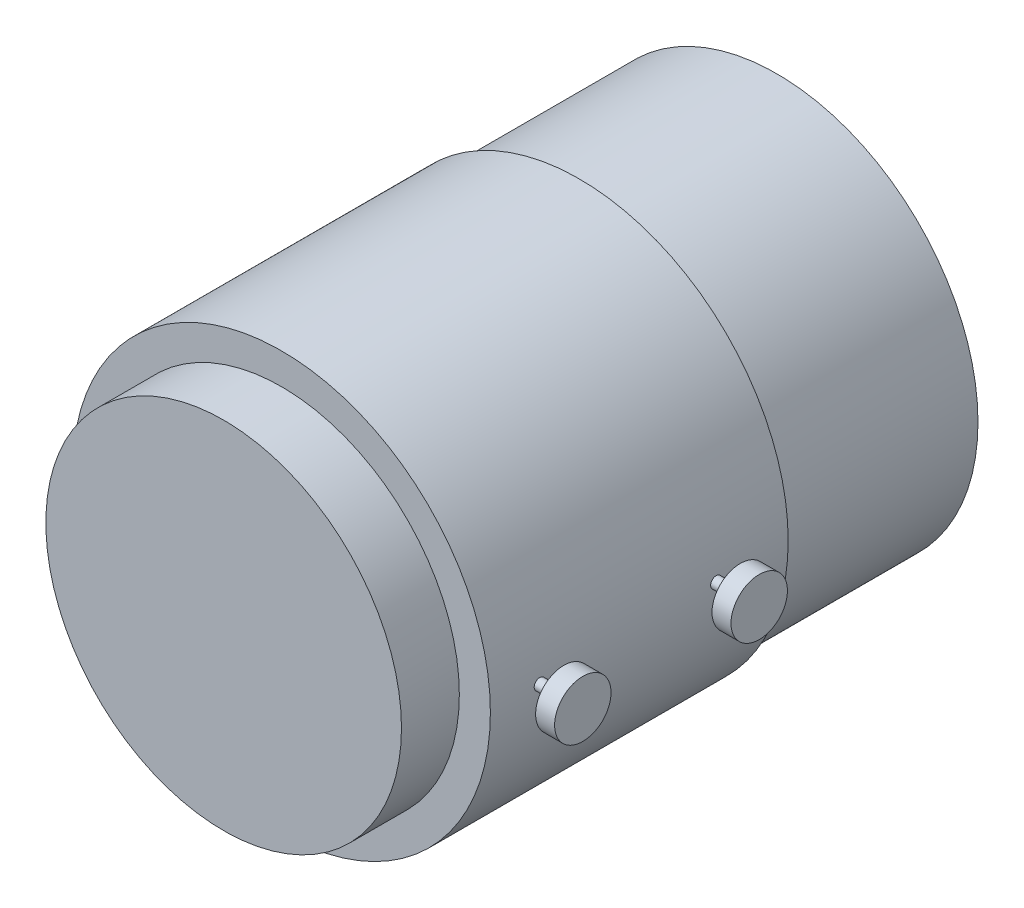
ISO-10303-21;
HEADER;
FILE_DESCRIPTION(('STEP AP214'),'2;1');
FILE_NAME('part.step','',(''),(''),'','','');
FILE_SCHEMA(('AUTOMOTIVE_DESIGN { 1 0 10303 214 1 1 1 1 }'));
ENDSEC;
DATA;
#1=APPLICATION_CONTEXT('core data for automotive mechanical design processes');
#2=APPLICATION_PROTOCOL_DEFINITION('international standard','automotive_design',2000,#1);
#3=PRODUCT_CONTEXT('',#1,'mechanical');
#4=PRODUCT('Part','Part','',(#3));
#5=PRODUCT_RELATED_PRODUCT_CATEGORY('part','',(#4));
#6=PRODUCT_DEFINITION_FORMATION('','',#4);
#7=PRODUCT_DEFINITION_CONTEXT('part definition',#1,'design');
#8=PRODUCT_DEFINITION('design','',#6,#7);
#9=PRODUCT_DEFINITION_SHAPE('','',#8);
#10=(LENGTH_UNIT() NAMED_UNIT(*) SI_UNIT(.MILLI.,.METRE.));
#11=(NAMED_UNIT(*) PLANE_ANGLE_UNIT() SI_UNIT($,.RADIAN.));
#12=(NAMED_UNIT(*) SI_UNIT($,.STERADIAN.) SOLID_ANGLE_UNIT());
#13=UNCERTAINTY_MEASURE_WITH_UNIT(LENGTH_MEASURE(1.E-05),#10,'distance_accuracy_value','');
#14=(GEOMETRIC_REPRESENTATION_CONTEXT(3) GLOBAL_UNCERTAINTY_ASSIGNED_CONTEXT((#13)) GLOBAL_UNIT_ASSIGNED_CONTEXT((#10,
#11,#12)) REPRESENTATION_CONTEXT('',''));
#15=CARTESIAN_POINT('',(0.,0.,0.));
#16=DIRECTION('',(0.,0.,1.));
#17=DIRECTION('',(1.,0.,0.));
#18=AXIS2_PLACEMENT_3D('',#15,#16,#17);
#19=CARTESIAN_POINT('',(0.,0.,21.1));
#20=DIRECTION('',(0.,0.,-1.));
#21=DIRECTION('',(-1.,0.,0.));
#22=AXIS2_PLACEMENT_3D('',#19,#20,#21);
#23=CYLINDRICAL_SURFACE('',#22,14.8);
#24=CARTESIAN_POINT('',(14.8,0.,5.49536780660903));
#25=CARTESIAN_POINT('',(14.7999999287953,-0.0222037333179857,5.49536682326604));
#26=CARTESIAN_POINT('',(14.79994949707,-0.0444234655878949,5.49349109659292));
#27=CARTESIAN_POINT('',(14.799753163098,-0.0882506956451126,5.48603464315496));
#28=CARTESIAN_POINT('',(14.7996071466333,-0.109857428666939,5.48044948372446));
#29=CARTESIAN_POINT('',(14.7992361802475,-0.151817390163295,5.46573353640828));
#30=CARTESIAN_POINT('',(14.7990112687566,-0.172171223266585,5.4566044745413));
#31=CARTESIAN_POINT('',(14.7985078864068,-0.211051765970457,5.43506231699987));
#32=CARTESIAN_POINT('',(14.7982294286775,-0.229578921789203,5.42265002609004));
#33=CARTESIAN_POINT('',(14.7976501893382,-0.264293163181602,5.39488796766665));
#34=CARTESIAN_POINT('',(14.7973494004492,-0.280479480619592,5.37953723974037));
#35=CARTESIAN_POINT('',(14.7967594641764,-0.310046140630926,5.34633565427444));
#36=CARTESIAN_POINT('',(14.7964703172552,-0.32342637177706,5.32848469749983));
#37=CARTESIAN_POINT('',(14.7959362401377,-0.347001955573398,5.29078689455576));
#38=CARTESIAN_POINT('',(14.7956913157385,-0.357196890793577,5.27093978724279));
#39=CARTESIAN_POINT('',(14.7952733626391,-0.374109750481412,5.22981494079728));
#40=CARTESIAN_POINT('',(14.7951003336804,-0.380827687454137,5.20853720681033));
#41=CARTESIAN_POINT('',(14.7948457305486,-0.390594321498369,5.16516050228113));
#42=CARTESIAN_POINT('',(14.7947641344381,-0.393643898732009,5.14306173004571));
#43=CARTESIAN_POINT('',(14.794701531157,-0.395989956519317,5.09866577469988));
#44=CARTESIAN_POINT('',(14.7947205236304,-0.395286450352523,5.07636859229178));
#45=CARTESIAN_POINT('',(14.7948569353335,-0.390147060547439,5.03221472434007));
#46=CARTESIAN_POINT('',(14.7949743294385,-0.385712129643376,5.01035792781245));
#47=CARTESIAN_POINT('',(14.7952942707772,-0.373237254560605,4.96769919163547));
#48=CARTESIAN_POINT('',(14.7954968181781,-0.365197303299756,4.9468972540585));
#49=CARTESIAN_POINT('',(14.7959642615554,-0.345739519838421,4.90693567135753));
#50=CARTESIAN_POINT('',(14.7962291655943,-0.334321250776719,4.88777623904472));
#51=CARTESIAN_POINT('',(14.7967914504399,-0.308431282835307,4.85164587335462));
#52=CARTESIAN_POINT('',(14.7970888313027,-0.293959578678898,4.8346749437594));
#53=CARTESIAN_POINT('',(14.7976826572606,-0.26236814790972,4.80339777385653));
#54=CARTESIAN_POINT('',(14.797979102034,-0.245247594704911,4.78909236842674));
#55=CARTESIAN_POINT('',(14.7985375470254,-0.208847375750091,4.76355875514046));
#56=CARTESIAN_POINT('',(14.7987995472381,-0.189567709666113,4.75233054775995));
#57=CARTESIAN_POINT('',(14.7992595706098,-0.149396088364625,4.73327015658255));
#58=CARTESIAN_POINT('',(14.7994575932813,-0.128504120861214,4.72543799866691));
#59=CARTESIAN_POINT('',(14.7997673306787,-0.0857011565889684,4.71339256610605));
#60=CARTESIAN_POINT('',(14.7998790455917,-0.0637901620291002,4.7091792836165));
#61=CARTESIAN_POINT('',(14.800003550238,-0.0195783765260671,4.70449222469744));
#62=CARTESIAN_POINT('',(14.800016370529,0.00272229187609,4.70401729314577));
#63=CARTESIAN_POINT('',(14.7999417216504,0.0470867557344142,4.70681740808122));
#64=CARTESIAN_POINT('',(14.7998542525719,0.0691505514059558,4.71009245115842));
#65=CARTESIAN_POINT('',(14.7995889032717,0.112411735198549,4.72029859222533));
#66=CARTESIAN_POINT('',(14.7994110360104,0.133609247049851,4.72722916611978));
#67=CARTESIAN_POINT('',(14.7989849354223,0.174539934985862,4.74454910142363));
#68=CARTESIAN_POINT('',(14.7987367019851,0.194273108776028,4.75493846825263));
#69=CARTESIAN_POINT('',(14.7981977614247,0.231720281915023,4.77888404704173));
#70=CARTESIAN_POINT('',(14.7979070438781,0.249433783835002,4.7924410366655));
#71=CARTESIAN_POINT('',(14.7973159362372,0.282333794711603,4.82233588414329));
#72=CARTESIAN_POINT('',(14.7970155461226,0.297520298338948,4.83867374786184));
#73=CARTESIAN_POINT('',(14.7964388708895,0.324939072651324,4.87367151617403));
#74=CARTESIAN_POINT('',(14.7961625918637,0.337170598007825,4.89233200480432));
#75=CARTESIAN_POINT('',(14.7956653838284,0.358327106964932,4.93144232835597));
#76=CARTESIAN_POINT('',(14.795444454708,0.36725209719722,4.95189215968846));
#77=CARTESIAN_POINT('',(14.7950828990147,0.381540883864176,4.99399786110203));
#78=CARTESIAN_POINT('',(14.794942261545,0.386905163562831,5.01565356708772));
#79=CARTESIAN_POINT('',(14.7947571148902,0.39392184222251,5.05955862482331));
#80=CARTESIAN_POINT('',(14.7947126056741,0.395574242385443,5.08180797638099));
#81=CARTESIAN_POINT('',(14.7947247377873,0.395120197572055,5.12626126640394));
#82=CARTESIAN_POINT('',(14.7947813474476,0.393014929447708,5.14846521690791));
#83=CARTESIAN_POINT('',(14.7949892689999,0.385107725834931,5.19220440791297));
#84=CARTESIAN_POINT('',(14.7951405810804,0.379305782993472,5.21373964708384));
#85=CARTESIAN_POINT('',(14.7955208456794,0.364170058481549,5.25553063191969));
#86=CARTESIAN_POINT('',(14.795749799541,0.3548362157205,5.27578635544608));
#87=CARTESIAN_POINT('',(14.796259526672,0.332902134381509,5.31444277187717));
#88=CARTESIAN_POINT('',(14.7965402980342,0.320302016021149,5.33284353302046));
#89=CARTESIAN_POINT('',(14.7971220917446,0.292189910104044,5.36727290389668));
#90=CARTESIAN_POINT('',(14.797423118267,0.276677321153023,5.38330102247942));
#91=CARTESIAN_POINT('',(14.7980115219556,0.243176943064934,5.41252978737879));
#92=CARTESIAN_POINT('',(14.7982988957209,0.225188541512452,5.42572973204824));
#93=CARTESIAN_POINT('',(14.7988276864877,0.187240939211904,5.44892924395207));
#94=CARTESIAN_POINT('',(14.7990690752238,0.167280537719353,5.45892684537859));
#95=CARTESIAN_POINT('',(14.7994781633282,0.125979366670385,5.47541737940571));
#96=CARTESIAN_POINT('',(14.7996459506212,0.104640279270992,5.48191449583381));
#97=CARTESIAN_POINT('',(14.7998440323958,0.0693051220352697,5.48949579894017));
#98=CARTESIAN_POINT('',(14.7999022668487,0.0555384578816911,5.49169503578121));
#99=CARTESIAN_POINT('',(14.7999802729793,0.0278499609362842,5.49463134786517));
#100=CARTESIAN_POINT('',(14.8000000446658,0.0139281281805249,5.49536842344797));
#101=CARTESIAN_POINT('',(14.8,0.,5.49536780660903));
#102=B_SPLINE_CURVE_WITH_KNOTS('',3,(#24,#25,#26,#27,#28,#29,#30,#31,#32,#33,#34,#35,#36,#37,
#38,#39,#40,#41,#42,#43,#44,#45,#46,#47,#48,#49,#50,#51,#52,#53,#54,#55,#56,#57,#58,#59,#60,#61,
#62,#63,#64,#65,#66,#67,#68,#69,#70,#71,#72,#73,#74,#75,#76,#77,#78,#79,#80,#81,#82,#83,#84,#85,
#86,#87,#88,#89,#90,#91,#92,#93,#94,#95,#96,#97,#98,#99,#100,#101),.UNSPECIFIED.,.T.,.F.,(4,2,2,
2,2,2,2,2,2,2,2,2,2,2,2,2,2,2,2,2,2,2,2,2,2,2,2,2,2,2,2,2,2,2,2,2,2,2,4),(0.,0.0665603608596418,
0.133200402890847,0.199808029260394,0.266399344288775,0.333012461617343,0.399628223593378,
0.466252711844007,0.53287696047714,0.599485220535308,0.666093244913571,0.732684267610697,
0.799275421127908,0.865875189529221,0.93247507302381,0.999095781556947,1.06571650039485,
1.13233772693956,1.19895880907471,1.26555930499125,1.33215974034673,1.39875062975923,
1.46534162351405,1.53194898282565,1.59855648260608,1.6651807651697,1.731804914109,
1.79842001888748,1.86503510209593,1.93162932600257,1.99822368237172,2.06481919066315,
2.13141224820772,2.19801907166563,2.26464240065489,2.33130654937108,2.39789084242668,
2.4396433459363,2.48139583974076),.UNSPECIFIED.);
#103=CARTESIAN_POINT('',(14.8,0.,5.49536780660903));
#104=VERTEX_POINT('',#103);
#105=EDGE_CURVE('E43',#104,#104,#102,.T.);
#106=ORIENTED_EDGE('',*,*,#105,.F.);
#107=EDGE_LOOP('',(#106));
#108=FACE_BOUND('',#107,.T.);
#109=CARTESIAN_POINT('',(0.,0.,21.1));
#110=DIRECTION('',(0.,0.,1.));
#111=DIRECTION('',(1.,0.,0.));
#112=AXIS2_PLACEMENT_3D('',#109,#110,#111);
#113=CIRCLE('',#112,14.8);
#114=CARTESIAN_POINT('',(14.8,0.,21.1));
#115=VERTEX_POINT('',#114);
#116=EDGE_CURVE('E51',#115,#115,#113,.T.);
#117=ORIENTED_EDGE('',*,*,#116,.F.);
#118=EDGE_LOOP('',(#117));
#119=FACE_BOUND('',#118,.T.);
#120=CARTESIAN_POINT('',(0.,0.,0.));
#121=DIRECTION('',(0.,0.,1.));
#122=DIRECTION('',(1.,0.,0.));
#123=AXIS2_PLACEMENT_3D('',#120,#121,#122);
#124=CIRCLE('',#123,14.8);
#125=CARTESIAN_POINT('',(14.8,0.,0.));
#126=VERTEX_POINT('',#125);
#127=EDGE_CURVE('E95',#126,#126,#124,.T.);
#128=ORIENTED_EDGE('',*,*,#127,.T.);
#129=EDGE_LOOP('',(#128));
#130=FACE_BOUND('',#129,.T.);
#131=CARTESIAN_POINT('',(14.8,0.,17.995367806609));
#132=CARTESIAN_POINT('',(14.7999999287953,-0.0222037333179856,17.995366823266));
#133=CARTESIAN_POINT('',(14.79994949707,-0.0444234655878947,17.9934910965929));
#134=CARTESIAN_POINT('',(14.799753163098,-0.0882506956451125,17.986034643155));
#135=CARTESIAN_POINT('',(14.7996071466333,-0.109857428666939,17.9804494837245));
#136=CARTESIAN_POINT('',(14.7992361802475,-0.151817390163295,17.9657335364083));
#137=CARTESIAN_POINT('',(14.7990112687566,-0.172171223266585,17.9566044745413));
#138=CARTESIAN_POINT('',(14.7985078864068,-0.211051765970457,17.9350623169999));
#139=CARTESIAN_POINT('',(14.7982294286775,-0.229578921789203,17.92265002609));
#140=CARTESIAN_POINT('',(14.7976501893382,-0.264293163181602,17.8948879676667));
#141=CARTESIAN_POINT('',(14.7973494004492,-0.280479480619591,17.8795372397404));
#142=CARTESIAN_POINT('',(14.7967594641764,-0.310046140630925,17.8463356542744));
#143=CARTESIAN_POINT('',(14.7964703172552,-0.32342637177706,17.8284846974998));
#144=CARTESIAN_POINT('',(14.7959362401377,-0.347001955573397,17.7907868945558));
#145=CARTESIAN_POINT('',(14.7956913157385,-0.357196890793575,17.7709397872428));
#146=CARTESIAN_POINT('',(14.7952733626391,-0.37410975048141,17.7298149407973));
#147=CARTESIAN_POINT('',(14.7951003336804,-0.380827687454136,17.7085372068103));
#148=CARTESIAN_POINT('',(14.7948457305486,-0.390594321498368,17.6651605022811));
#149=CARTESIAN_POINT('',(14.7947641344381,-0.393643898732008,17.6430617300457));
#150=CARTESIAN_POINT('',(14.794701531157,-0.395989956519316,17.5986657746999));
#151=CARTESIAN_POINT('',(14.7947205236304,-0.395286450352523,17.5763685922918));
#152=CARTESIAN_POINT('',(14.7948569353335,-0.390147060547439,17.5322147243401));
#153=CARTESIAN_POINT('',(14.7949743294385,-0.385712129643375,17.5103579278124));
#154=CARTESIAN_POINT('',(14.7952942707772,-0.373237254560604,17.4676991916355));
#155=CARTESIAN_POINT('',(14.7954968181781,-0.365197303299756,17.4468972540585));
#156=CARTESIAN_POINT('',(14.7959642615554,-0.345739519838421,17.4069356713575));
#157=CARTESIAN_POINT('',(14.7962291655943,-0.334321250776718,17.3877762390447));
#158=CARTESIAN_POINT('',(14.7967914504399,-0.308431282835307,17.3516458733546));
#159=CARTESIAN_POINT('',(14.7970888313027,-0.293959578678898,17.3346749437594));
#160=CARTESIAN_POINT('',(14.7976826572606,-0.262368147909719,17.3033977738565));
#161=CARTESIAN_POINT('',(14.797979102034,-0.245247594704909,17.2890923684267));
#162=CARTESIAN_POINT('',(14.7985375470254,-0.208847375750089,17.2635587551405));
#163=CARTESIAN_POINT('',(14.7987995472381,-0.189567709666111,17.25233054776));
#164=CARTESIAN_POINT('',(14.7992595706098,-0.149396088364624,17.2332701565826));
#165=CARTESIAN_POINT('',(14.7994575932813,-0.128504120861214,17.2254379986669));
#166=CARTESIAN_POINT('',(14.7997673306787,-0.085701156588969,17.2133925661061));
#167=CARTESIAN_POINT('',(14.7998790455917,-0.0637901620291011,17.2091792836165));
#168=CARTESIAN_POINT('',(14.800003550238,-0.019578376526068,17.2044922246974));
#169=CARTESIAN_POINT('',(14.800016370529,0.00272229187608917,17.2040172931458));
#170=CARTESIAN_POINT('',(14.7999417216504,0.0470867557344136,17.2068174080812));
#171=CARTESIAN_POINT('',(14.7998542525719,0.0691505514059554,17.2100924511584));
#172=CARTESIAN_POINT('',(14.7995889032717,0.112411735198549,17.2202985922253));
#173=CARTESIAN_POINT('',(14.7994110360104,0.133609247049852,17.2272291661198));
#174=CARTESIAN_POINT('',(14.7989849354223,0.174539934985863,17.2445491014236));
#175=CARTESIAN_POINT('',(14.7987367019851,0.194273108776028,17.2549384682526));
#176=CARTESIAN_POINT('',(14.7981977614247,0.231720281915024,17.2788840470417));
#177=CARTESIAN_POINT('',(14.7979070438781,0.249433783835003,17.2924410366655));
#178=CARTESIAN_POINT('',(14.7973159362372,0.282333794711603,17.3223358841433));
#179=CARTESIAN_POINT('',(14.7970155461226,0.297520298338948,17.3386737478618));
#180=CARTESIAN_POINT('',(14.7964388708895,0.324939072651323,17.373671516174));
#181=CARTESIAN_POINT('',(14.7961625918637,0.337170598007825,17.3923320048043));
#182=CARTESIAN_POINT('',(14.7956653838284,0.358327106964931,17.431442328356));
#183=CARTESIAN_POINT('',(14.795444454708,0.367252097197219,17.4518921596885));
#184=CARTESIAN_POINT('',(14.7950828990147,0.381540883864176,17.493997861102));
#185=CARTESIAN_POINT('',(14.794942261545,0.386905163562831,17.5156535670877));
#186=CARTESIAN_POINT('',(14.7947571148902,0.393921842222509,17.5595586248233));
#187=CARTESIAN_POINT('',(14.7947126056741,0.395574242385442,17.581807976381));
#188=CARTESIAN_POINT('',(14.7947247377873,0.395120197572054,17.6262612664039));
#189=CARTESIAN_POINT('',(14.7947813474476,0.393014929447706,17.6484652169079));
#190=CARTESIAN_POINT('',(14.7949892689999,0.38510772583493,17.692204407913));
#191=CARTESIAN_POINT('',(14.7951405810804,0.379305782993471,17.7137396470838));
#192=CARTESIAN_POINT('',(14.7955208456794,0.364170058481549,17.7555306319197));
#193=CARTESIAN_POINT('',(14.795749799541,0.354836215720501,17.7757863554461));
#194=CARTESIAN_POINT('',(14.796259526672,0.33290213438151,17.8144427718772));
#195=CARTESIAN_POINT('',(14.7965402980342,0.32030201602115,17.8328435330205));
#196=CARTESIAN_POINT('',(14.7971220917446,0.292189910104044,17.8672729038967));
#197=CARTESIAN_POINT('',(14.797423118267,0.276677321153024,17.8833010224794));
#198=CARTESIAN_POINT('',(14.7980115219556,0.243176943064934,17.9125297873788));
#199=CARTESIAN_POINT('',(14.7982988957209,0.22518854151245,17.9257297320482));
#200=CARTESIAN_POINT('',(14.7988276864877,0.187240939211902,17.9489292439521));
#201=CARTESIAN_POINT('',(14.7990690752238,0.167280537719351,17.9589268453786));
#202=CARTESIAN_POINT('',(14.7994781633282,0.125979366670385,17.9754173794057));
#203=CARTESIAN_POINT('',(14.7996459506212,0.104640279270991,17.9819144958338));
#204=CARTESIAN_POINT('',(14.7998440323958,0.0693051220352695,17.9894957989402));
#205=CARTESIAN_POINT('',(14.7999022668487,0.0555384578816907,17.9916950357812));
#206=CARTESIAN_POINT('',(14.7999802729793,0.0278499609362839,17.9946313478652));
#207=CARTESIAN_POINT('',(14.8000000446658,0.0139281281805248,17.995368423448));
#208=CARTESIAN_POINT('',(14.8,0.,17.995367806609));
#209=B_SPLINE_CURVE_WITH_KNOTS('',3,(#131,#132,#133,#134,#135,#136,#137,#138,#139,#140,#141,
#142,#143,#144,#145,#146,#147,#148,#149,#150,#151,#152,#153,#154,#155,#156,#157,#158,#159,#160,
#161,#162,#163,#164,#165,#166,#167,#168,#169,#170,#171,#172,#173,#174,#175,#176,#177,#178,#179,
#180,#181,#182,#183,#184,#185,#186,#187,#188,#189,#190,#191,#192,#193,#194,#195,#196,#197,#198,
#199,#200,#201,#202,#203,#204,#205,#206,#207,#208),.UNSPECIFIED.,.T.,.F.,(4,2,2,2,2,2,2,2,2,2,2,
2,2,2,2,2,2,2,2,2,2,2,2,2,2,2,2,2,2,2,2,2,2,2,2,2,2,2,4),(0.,0.0665603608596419,
0.133200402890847,0.199808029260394,0.266399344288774,0.333012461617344,0.399628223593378,
0.466252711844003,0.532876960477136,0.599485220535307,0.666093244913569,0.732684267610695,
0.799275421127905,0.86587518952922,0.932475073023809,0.999095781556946,1.06571650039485,
1.13233772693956,1.19895880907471,1.26555930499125,1.33215974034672,1.39875062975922,
1.46534162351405,1.53194898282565,1.59855648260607,1.66518076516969,1.73180491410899,
1.79842001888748,1.86503510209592,1.93162932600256,1.99822368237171,2.06481919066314,
2.13141224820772,2.19801907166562,2.26464240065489,2.33130654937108,2.39789084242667,
2.4396433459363,2.48139583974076),.UNSPECIFIED.);
#210=CARTESIAN_POINT('',(14.8,0.,17.995367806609));
#211=VERTEX_POINT('',#210);
#212=EDGE_CURVE('E10',#211,#211,#209,.T.);
#213=ORIENTED_EDGE('',*,*,#212,.F.);
#214=EDGE_LOOP('',(#213));
#215=FACE_BOUND('',#214,.T.);
#216=ADVANCED_FACE('F32',(#108,#119,#130,#215),#23,.T.);
#217=CARTESIAN_POINT('',(0.,0.,0.));
#218=DIRECTION('',(0.,0.,1.));
#219=DIRECTION('',(1.,0.,0.));
#220=AXIS2_PLACEMENT_3D('',#217,#218,#219);
#221=PLANE('',#220);
#222=ORIENTED_EDGE('',*,*,#127,.F.);
#223=EDGE_LOOP('',(#222));
#224=FACE_BOUND('',#223,.T.);
#225=CARTESIAN_POINT('',(0.,0.,0.));
#226=DIRECTION('',(0.,0.,1.));
#227=DIRECTION('',(1.,0.,0.));
#228=AXIS2_PLACEMENT_3D('',#225,#226,#227);
#229=CIRCLE('',#228,14.25);
#230=CARTESIAN_POINT('',(14.25,0.,0.));
#231=VERTEX_POINT('',#230);
#232=EDGE_CURVE('E47',#231,#231,#229,.F.);
#233=ORIENTED_EDGE('',*,*,#232,.F.);
#234=EDGE_LOOP('',(#233));
#235=FACE_BOUND('',#234,.T.);
#236=ADVANCED_FACE('F84',(#224,#235),#221,.F.);
#237=CARTESIAN_POINT('',(0.,0.,21.1));
#238=DIRECTION('',(0.,0.,1.));
#239=DIRECTION('',(1.,0.,0.));
#240=AXIS2_PLACEMENT_3D('',#237,#238,#239);
#241=PLANE('',#240);
#242=ORIENTED_EDGE('',*,*,#116,.T.);
#243=EDGE_LOOP('',(#242));
#244=FACE_BOUND('',#243,.T.);
#245=CARTESIAN_POINT('',(0.,0.,21.1));
#246=DIRECTION('',(0.,0.,1.));
#247=DIRECTION('',(1.,0.,0.));
#248=AXIS2_PLACEMENT_3D('',#245,#246,#247);
#249=CIRCLE('',#248,12.6);
#250=CARTESIAN_POINT('',(12.6,0.,21.1));
#251=VERTEX_POINT('',#250);
#252=EDGE_CURVE('E103',#251,#251,#249,.T.);
#253=ORIENTED_EDGE('',*,*,#252,.F.);
#254=EDGE_LOOP('',(#253));
#255=FACE_BOUND('',#254,.T.);
#256=ADVANCED_FACE('F81',(#244,#255),#241,.T.);
#257=CARTESIAN_POINT('',(0.,0.,25.2));
#258=DIRECTION('',(0.,0.,-1.));
#259=DIRECTION('',(-1.,0.,0.));
#260=AXIS2_PLACEMENT_3D('',#257,#258,#259);
#261=CYLINDRICAL_SURFACE('',#260,12.6);
#262=CARTESIAN_POINT('',(0.,0.,25.2));
#263=DIRECTION('',(0.,0.,1.));
#264=DIRECTION('',(1.,0.,0.));
#265=AXIS2_PLACEMENT_3D('',#262,#263,#264);
#266=CIRCLE('',#265,12.6);
#267=CARTESIAN_POINT('',(12.6,0.,25.2));
#268=VERTEX_POINT('',#267);
#269=EDGE_CURVE('E99',#268,#268,#266,.T.);
#270=ORIENTED_EDGE('',*,*,#269,.F.);
#271=EDGE_LOOP('',(#270));
#272=FACE_BOUND('',#271,.T.);
#273=ORIENTED_EDGE('',*,*,#252,.T.);
#274=EDGE_LOOP('',(#273));
#275=FACE_BOUND('',#274,.T.);
#276=ADVANCED_FACE('F77',(#272,#275),#261,.T.);
#277=CARTESIAN_POINT('',(0.,0.,25.2));
#278=DIRECTION('',(0.,0.,1.));
#279=DIRECTION('',(1.,0.,0.));
#280=AXIS2_PLACEMENT_3D('',#277,#278,#279);
#281=PLANE('',#280);
#282=ORIENTED_EDGE('',*,*,#269,.T.);
#283=EDGE_LOOP('',(#282));
#284=FACE_BOUND('',#283,.T.);
#285=ADVANCED_FACE('F73',(#284),#281,.T.);
#286=CARTESIAN_POINT('',(0.,0.,-14.));
#287=DIRECTION('',(0.,0.,1.));
#288=DIRECTION('',(1.,0.,0.));
#289=AXIS2_PLACEMENT_3D('',#286,#287,#288);
#290=CYLINDRICAL_SURFACE('',#289,14.25);
#291=CARTESIAN_POINT('',(0.,0.,-14.));
#292=DIRECTION('',(0.,0.,-1.));
#293=DIRECTION('',(-1.,0.,0.));
#294=AXIS2_PLACEMENT_3D('',#291,#292,#293);
#295=CIRCLE('',#294,14.25);
#296=CARTESIAN_POINT('',(-14.25,0.,-14.));
#297=VERTEX_POINT('',#296);
#298=EDGE_CURVE('E107',#297,#297,#295,.T.);
#299=ORIENTED_EDGE('',*,*,#298,.F.);
#300=EDGE_LOOP('',(#299));
#301=FACE_BOUND('',#300,.T.);
#302=ORIENTED_EDGE('',*,*,#232,.T.);
#303=EDGE_LOOP('',(#302));
#304=FACE_BOUND('',#303,.T.);
#305=ADVANCED_FACE('F69',(#301,#304),#290,.T.);
#306=CARTESIAN_POINT('',(0.,0.,-14.));
#307=DIRECTION('',(0.,0.,-1.));
#308=DIRECTION('',(-1.,0.,0.));
#309=AXIS2_PLACEMENT_3D('',#306,#307,#308);
#310=PLANE('',#309);
#311=ORIENTED_EDGE('',*,*,#298,.T.);
#312=EDGE_LOOP('',(#311));
#313=FACE_BOUND('',#312,.T.);
#314=ADVANCED_FACE('F64',(#313),#310,.T.);
#315=CARTESIAN_POINT('',(0.,0.,5.1));
#316=DIRECTION('',(-1.,0.,0.));
#317=DIRECTION('',(0.,0.,1.));
#318=AXIS2_PLACEMENT_3D('',#315,#316,#317);
#319=CYLINDRICAL_SURFACE('',#318,0.395367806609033);
#320=CARTESIAN_POINT('',(16.5037493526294,0.,5.1));
#321=DIRECTION('',(-1.,0.,0.));
#322=DIRECTION('',(0.,0.,1.));
#323=AXIS2_PLACEMENT_3D('',#320,#321,#322);
#324=CIRCLE('',#323,0.395367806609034);
#325=CARTESIAN_POINT('',(16.5037493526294,0.,5.49536780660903));
#326=VERTEX_POINT('',#325);
#327=EDGE_CURVE('E117',#326,#326,#324,.T.);
#328=ORIENTED_EDGE('',*,*,#327,.T.);
#329=EDGE_LOOP('',(#328));
#330=FACE_BOUND('',#329,.T.);
#331=ORIENTED_EDGE('',*,*,#105,.T.);
#332=EDGE_LOOP('',(#331));
#333=FACE_BOUND('',#332,.T.);
#334=ADVANCED_FACE('F58',(#330,#333),#319,.T.);
#335=CARTESIAN_POINT('',(17.848,0.,0.));
#336=DIRECTION('',(-1.,0.,0.));
#337=DIRECTION('',(0.,0.,1.));
#338=AXIS2_PLACEMENT_3D('',#335,#336,#337);
#339=PLANE('',#338);
#340=CARTESIAN_POINT('',(17.848,0.,5.1));
#341=DIRECTION('',(-1.,0.,0.));
#342=DIRECTION('',(0.,0.,1.));
#343=AXIS2_PLACEMENT_3D('',#340,#341,#342);
#344=CIRCLE('',#343,2.);
#345=CARTESIAN_POINT('',(17.848,0.,7.1));
#346=VERTEX_POINT('',#345);
#347=EDGE_CURVE('E111',#346,#346,#344,.T.);
#348=ORIENTED_EDGE('',*,*,#347,.F.);
#349=EDGE_LOOP('',(#348));
#350=FACE_BOUND('',#349,.T.);
#351=ADVANCED_FACE('F63',(#350),#339,.F.);
#352=CARTESIAN_POINT('',(0.,0.,5.1));
#353=DIRECTION('',(-1.,0.,0.));
#354=DIRECTION('',(0.,0.,1.));
#355=AXIS2_PLACEMENT_3D('',#352,#353,#354);
#356=CYLINDRICAL_SURFACE('',#355,2.);
#357=CARTESIAN_POINT('',(16.5037493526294,0.,5.1));
#358=DIRECTION('',(-1.,0.,0.));
#359=DIRECTION('',(0.,0.,1.));
#360=AXIS2_PLACEMENT_3D('',#357,#358,#359);
#361=CIRCLE('',#360,2.);
#362=CARTESIAN_POINT('',(16.5037493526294,0.,7.1));
#363=VERTEX_POINT('',#362);
#364=EDGE_CURVE('E114',#363,#363,#361,.T.);
#365=ORIENTED_EDGE('',*,*,#364,.F.);
#366=EDGE_LOOP('',(#365));
#367=FACE_BOUND('',#366,.T.);
#368=ORIENTED_EDGE('',*,*,#347,.T.);
#369=EDGE_LOOP('',(#368));
#370=FACE_BOUND('',#369,.T.);
#371=ADVANCED_FACE('F154',(#367,#370),#356,.T.);
#372=CARTESIAN_POINT('',(16.5037493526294,0.,0.));
#373=DIRECTION('',(1.,0.,0.));
#374=DIRECTION('',(0.,0.,-1.));
#375=AXIS2_PLACEMENT_3D('',#372,#373,#374);
#376=PLANE('',#375);
#377=ORIENTED_EDGE('',*,*,#327,.F.);
#378=EDGE_LOOP('',(#377));
#379=FACE_BOUND('',#378,.T.);
#380=ORIENTED_EDGE('',*,*,#364,.T.);
#381=EDGE_LOOP('',(#380));
#382=FACE_BOUND('',#381,.T.);
#383=ADVANCED_FACE('F150',(#379,#382),#376,.F.);
#384=CARTESIAN_POINT('',(0.,0.,17.6));
#385=DIRECTION('',(-1.,0.,0.));
#386=DIRECTION('',(0.,0.,1.));
#387=AXIS2_PLACEMENT_3D('',#384,#385,#386);
#388=CYLINDRICAL_SURFACE('',#387,0.395367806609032);
#389=CARTESIAN_POINT('',(16.5037493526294,0.,17.6));
#390=DIRECTION('',(-1.,0.,0.));
#391=DIRECTION('',(0.,0.,1.));
#392=AXIS2_PLACEMENT_3D('',#389,#390,#391);
#393=CIRCLE('',#392,0.395367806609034);
#394=CARTESIAN_POINT('',(16.5037493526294,0.,17.995367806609));
#395=VERTEX_POINT('',#394);
#396=EDGE_CURVE('E126',#395,#395,#393,.T.);
#397=ORIENTED_EDGE('',*,*,#396,.T.);
#398=EDGE_LOOP('',(#397));
#399=FACE_BOUND('',#398,.T.);
#400=ORIENTED_EDGE('',*,*,#212,.T.);
#401=EDGE_LOOP('',(#400));
#402=FACE_BOUND('',#401,.T.);
#403=ADVANCED_FACE('F130',(#399,#402),#388,.T.);
#404=CARTESIAN_POINT('',(17.848,0.,0.));
#405=DIRECTION('',(-1.,0.,0.));
#406=DIRECTION('',(0.,0.,1.));
#407=AXIS2_PLACEMENT_3D('',#404,#405,#406);
#408=PLANE('',#407);
#409=CARTESIAN_POINT('',(17.848,0.,17.6));
#410=DIRECTION('',(-1.,0.,0.));
#411=DIRECTION('',(0.,0.,1.));
#412=AXIS2_PLACEMENT_3D('',#409,#410,#411);
#413=CIRCLE('',#412,2.);
#414=CARTESIAN_POINT('',(17.848,0.,19.6));
#415=VERTEX_POINT('',#414);
#416=EDGE_CURVE('E120',#415,#415,#413,.T.);
#417=ORIENTED_EDGE('',*,*,#416,.F.);
#418=EDGE_LOOP('',(#417));
#419=FACE_BOUND('',#418,.T.);
#420=ADVANCED_FACE('F141',(#419),#408,.F.);
#421=CARTESIAN_POINT('',(0.,0.,17.6));
#422=DIRECTION('',(-1.,0.,0.));
#423=DIRECTION('',(0.,0.,1.));
#424=AXIS2_PLACEMENT_3D('',#421,#422,#423);
#425=CYLINDRICAL_SURFACE('',#424,2.);
#426=CARTESIAN_POINT('',(16.5037493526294,0.,17.6));
#427=DIRECTION('',(-1.,0.,0.));
#428=DIRECTION('',(0.,0.,1.));
#429=AXIS2_PLACEMENT_3D('',#426,#427,#428);
#430=CIRCLE('',#429,2.);
#431=CARTESIAN_POINT('',(16.5037493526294,0.,19.6));
#432=VERTEX_POINT('',#431);
#433=EDGE_CURVE('E123',#432,#432,#430,.T.);
#434=ORIENTED_EDGE('',*,*,#433,.F.);
#435=EDGE_LOOP('',(#434));
#436=FACE_BOUND('',#435,.T.);
#437=ORIENTED_EDGE('',*,*,#416,.T.);
#438=EDGE_LOOP('',(#437));
#439=FACE_BOUND('',#438,.T.);
#440=ADVANCED_FACE('F135',(#436,#439),#425,.T.);
#441=CARTESIAN_POINT('',(16.5037493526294,0.,0.));
#442=DIRECTION('',(1.,0.,0.));
#443=DIRECTION('',(0.,0.,-1.));
#444=AXIS2_PLACEMENT_3D('',#441,#442,#443);
#445=PLANE('',#444);
#446=ORIENTED_EDGE('',*,*,#396,.F.);
#447=EDGE_LOOP('',(#446));
#448=FACE_BOUND('',#447,.T.);
#449=ORIENTED_EDGE('',*,*,#433,.T.);
#450=EDGE_LOOP('',(#449));
#451=FACE_BOUND('',#450,.T.);
#452=ADVANCED_FACE('F132',(#448,#451),#445,.F.);
#453=CLOSED_SHELL('',(#216,#236,#256,#276,#285,#305,#314,#334,#351,#371,#383,#403,#420,#440,#452));
#454=MANIFOLD_SOLID_BREP('B2',#453);
#455=ADVANCED_BREP_SHAPE_REPRESENTATION('',(#18,#454),#14);
#456=SHAPE_DEFINITION_REPRESENTATION(#9,#455);
ENDSEC;
END-ISO-10303-21;
